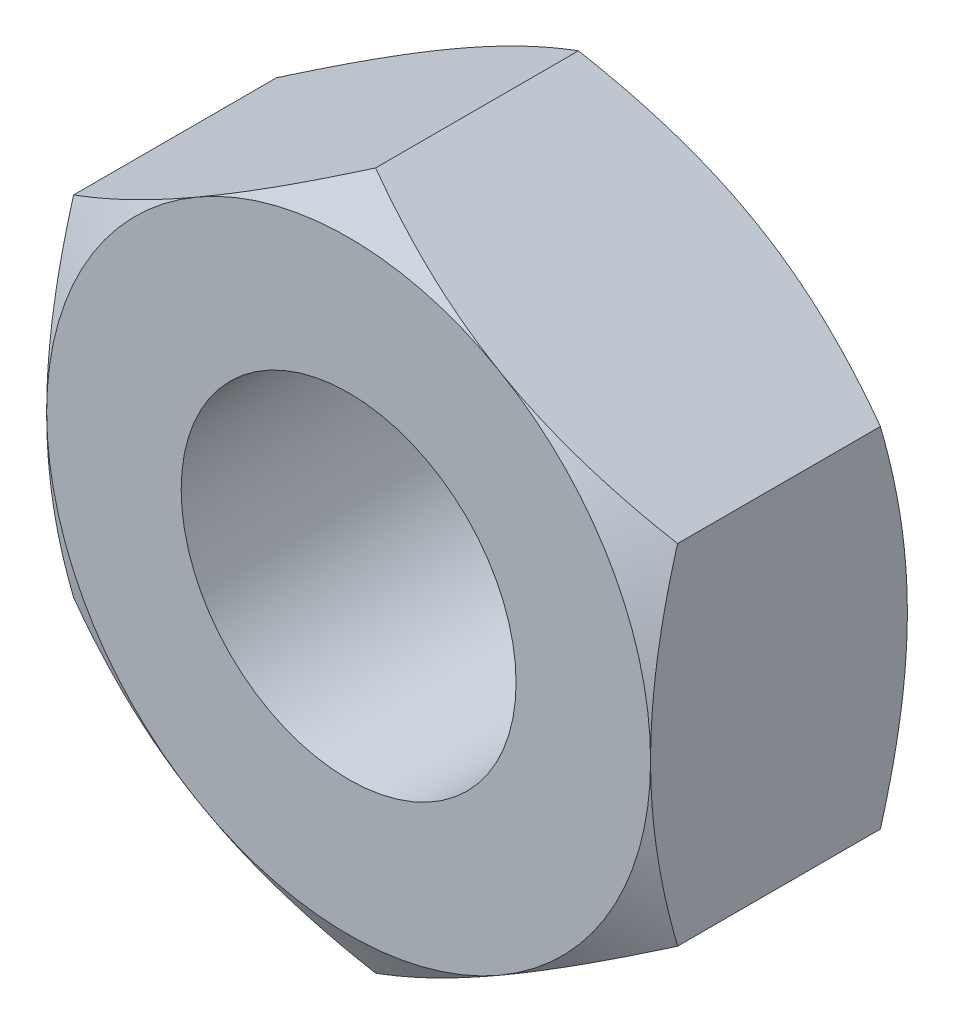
ISO-10303-21;
HEADER;
FILE_DESCRIPTION(('STEP AP214'),'2;1');
FILE_NAME('part.step','',(''),(''),'','','');
FILE_SCHEMA(('AUTOMOTIVE_DESIGN { 1 0 10303 214 1 1 1 1 }'));
ENDSEC;
DATA;
#1=APPLICATION_CONTEXT('core data for automotive mechanical design processes');
#2=APPLICATION_PROTOCOL_DEFINITION('international standard','automotive_design',2000,#1);
#3=PRODUCT_CONTEXT('',#1,'mechanical');
#4=PRODUCT('Part','Part','',(#3));
#5=PRODUCT_RELATED_PRODUCT_CATEGORY('part','',(#4));
#6=PRODUCT_DEFINITION_FORMATION('','',#4);
#7=PRODUCT_DEFINITION_CONTEXT('part definition',#1,'design');
#8=PRODUCT_DEFINITION('design','',#6,#7);
#9=PRODUCT_DEFINITION_SHAPE('','',#8);
#10=(LENGTH_UNIT() NAMED_UNIT(*) SI_UNIT(.MILLI.,.METRE.));
#11=(NAMED_UNIT(*) PLANE_ANGLE_UNIT() SI_UNIT($,.RADIAN.));
#12=(NAMED_UNIT(*) SI_UNIT($,.STERADIAN.) SOLID_ANGLE_UNIT());
#13=UNCERTAINTY_MEASURE_WITH_UNIT(LENGTH_MEASURE(1.E-05),#10,'distance_accuracy_value','');
#14=(GEOMETRIC_REPRESENTATION_CONTEXT(3) GLOBAL_UNCERTAINTY_ASSIGNED_CONTEXT((#13)) GLOBAL_UNIT_ASSIGNED_CONTEXT((#10,
#11,#12)) REPRESENTATION_CONTEXT('',''));
#15=CARTESIAN_POINT('',(0.,0.,0.));
#16=DIRECTION('',(0.,0.,1.));
#17=DIRECTION('',(1.,0.,0.));
#18=AXIS2_PLACEMENT_3D('',#15,#16,#17);
#19=CARTESIAN_POINT('',(-2.705,4.68519743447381,0.));
#20=DIRECTION('',(0.,0.,-1.));
#21=DIRECTION('',(-1.,0.,0.));
#22=AXIS2_PLACEMENT_3D('',#19,#20,#21);
#23=PLANE('',#22);
#24=CARTESIAN_POINT('',(0.,0.,0.));
#25=DIRECTION('',(0.,0.,1.));
#26=DIRECTION('',(1.,0.,0.));
#27=AXIS2_PLACEMENT_3D('',#24,#25,#26);
#28=CIRCLE('',#27,1.5);
#29=CARTESIAN_POINT('',(1.5,0.,0.));
#30=VERTEX_POINT('',#29);
#31=EDGE_CURVE('E316',#30,#30,#28,.T.);
#32=ORIENTED_EDGE('',*,*,#31,.F.);
#33=EDGE_LOOP('',(#32));
#34=FACE_BOUND('',#33,.T.);
#35=CARTESIAN_POINT('',(0.,0.,0.));
#36=DIRECTION('',(0.,0.,-1.));
#37=DIRECTION('',(-1.,0.,0.));
#38=AXIS2_PLACEMENT_3D('',#35,#36,#37);
#39=CIRCLE('',#38,2.705);
#40=CARTESIAN_POINT('',(-2.705,0.,0.));
#41=VERTEX_POINT('',#40);
#42=CARTESIAN_POINT('',(-1.3525,2.34259871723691,0.));
#43=VERTEX_POINT('',#42);
#44=EDGE_CURVE('E324',#41,#43,#39,.T.);
#45=ORIENTED_EDGE('',*,*,#44,.F.);
#46=CARTESIAN_POINT('',(0.,0.,0.));
#47=DIRECTION('',(0.,0.,-1.));
#48=DIRECTION('',(-1.,0.,0.));
#49=AXIS2_PLACEMENT_3D('',#46,#47,#48);
#50=CIRCLE('',#49,2.705);
#51=CARTESIAN_POINT('',(-1.3525,-2.34259871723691,0.));
#52=VERTEX_POINT('',#51);
#53=EDGE_CURVE('E147',#41,#52,#50,.F.);
#54=ORIENTED_EDGE('',*,*,#53,.T.);
#55=CARTESIAN_POINT('',(1.3525,-2.34259871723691,0.));
#56=VERTEX_POINT('',#55);
#57=EDGE_CURVE('E248',#52,#56,#50,.F.);
#58=ORIENTED_EDGE('',*,*,#57,.T.);
#59=CARTESIAN_POINT('',(2.705,0.,0.));
#60=VERTEX_POINT('',#59);
#61=EDGE_CURVE('E150',#56,#60,#50,.F.);
#62=ORIENTED_EDGE('',*,*,#61,.T.);
#63=CARTESIAN_POINT('',(1.3525,2.34259871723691,0.));
#64=VERTEX_POINT('',#63);
#65=EDGE_CURVE('E125',#60,#64,#50,.F.);
#66=ORIENTED_EDGE('',*,*,#65,.T.);
#67=EDGE_CURVE('E138',#64,#43,#50,.F.);
#68=ORIENTED_EDGE('',*,*,#67,.T.);
#69=EDGE_LOOP('',(#45,#54,#58,#62,#66,#68));
#70=FACE_BOUND('',#69,.T.);
#71=ADVANCED_FACE('F30',(#34,#70),#23,.F.);
#72=CARTESIAN_POINT('',(0.,0.,0.));
#73=DIRECTION('',(0.,0.,-1.));
#74=DIRECTION('',(-1.,0.,0.));
#75=AXIS2_PLACEMENT_3D('',#72,#73,#74);
#76=CONICAL_SURFACE('',#75,2.705,1.0471975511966);
#77=CARTESIAN_POINT('',(-2.705,-4.26927198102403,-1.35624103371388));
#78=CARTESIAN_POINT('',(-2.705,-4.15048650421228,-1.29832473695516));
#79=CARTESIAN_POINT('',(-2.705,-4.03143620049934,-1.24094267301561));
#80=CARTESIAN_POINT('',(-2.705,-3.79266538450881,-1.12754604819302));
#81=CARTESIAN_POINT('',(-2.705,-3.6729447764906,-1.07153168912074));
#82=CARTESIAN_POINT('',(-2.705,-3.43211076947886,-0.960903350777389));
#83=CARTESIAN_POINT('',(-2.705,-3.31099337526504,-0.906298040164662));
#84=CARTESIAN_POINT('',(-2.705,-3.06782093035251,-0.799224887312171));
#85=CARTESIAN_POINT('',(-2.705,-2.94576592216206,-0.746756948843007));
#86=CARTESIAN_POINT('',(-2.705,-2.69630359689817,-0.642760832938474));
#87=CARTESIAN_POINT('',(-2.705,-2.5688566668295,-0.591327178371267));
#88=CARTESIAN_POINT('',(-2.705,-2.31249937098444,-0.492175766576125));
#89=CARTESIAN_POINT('',(-2.705,-2.18358884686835,-0.444458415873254));
#90=CARTESIAN_POINT('',(-2.705,-1.92431755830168,-0.353938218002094));
#91=CARTESIAN_POINT('',(-2.705,-1.79396008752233,-0.311126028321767));
#92=CARTESIAN_POINT('',(-2.705,-1.53137640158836,-0.231740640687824));
#93=CARTESIAN_POINT('',(-2.705,-1.39915076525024,-0.195165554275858));
#94=CARTESIAN_POINT('',(-2.705,-1.13350806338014,-0.130159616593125));
#95=CARTESIAN_POINT('',(-2.705,-1.00010270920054,-0.101681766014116));
#96=CARTESIAN_POINT('',(-2.705,-0.73155757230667,-0.054423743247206));
#97=CARTESIAN_POINT('',(-2.705,-0.596417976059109,-0.0356425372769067));
#98=CARTESIAN_POINT('',(-2.705,-0.326873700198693,-0.00951805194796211));
#99=CARTESIAN_POINT('',(-2.705,-0.19248419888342,-0.00202203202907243));
#100=CARTESIAN_POINT('',(-2.705,0.0764530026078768,0.00130372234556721));
#101=CARTESIAN_POINT('',(-2.705,0.211000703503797,-0.00286659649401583));
#102=CARTESIAN_POINT('',(-2.705,0.437276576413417,-0.0193888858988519));
#103=CARTESIAN_POINT('',(-2.705,0.529236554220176,-0.0287742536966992));
#104=CARTESIAN_POINT('',(-2.705,0.712529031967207,-0.0524491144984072));
#105=CARTESIAN_POINT('',(-2.705,0.803861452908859,-0.0667392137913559));
#106=CARTESIAN_POINT('',(-2.705,1.07675813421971,-0.116222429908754));
#107=CARTESIAN_POINT('',(-2.705,1.2571301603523,-0.158020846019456));
#108=CARTESIAN_POINT('',(-2.705,1.61830335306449,-0.255754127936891));
#109=CARTESIAN_POINT('',(-2.705,1.79901948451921,-0.31199122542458));
#110=CARTESIAN_POINT('',(-2.705,2.06757071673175,-0.40352401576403));
#111=CARTESIAN_POINT('',(-2.705,2.1566605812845,-0.435228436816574));
#112=CARTESIAN_POINT('',(-2.705,2.33409482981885,-0.50065730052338));
#113=CARTESIAN_POINT('',(-2.705,2.42243922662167,-0.534381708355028));
#114=CARTESIAN_POINT('',(-2.705,2.64533459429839,-0.621921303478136));
#115=CARTESIAN_POINT('',(-2.705,2.77943863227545,-0.676871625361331));
#116=CARTESIAN_POINT('',(-2.705,3.04636906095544,-0.789802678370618));
#117=CARTESIAN_POINT('',(-2.705,3.17919534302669,-0.847783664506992));
#118=CARTESIAN_POINT('',(-2.705,3.44383155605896,-0.966111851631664));
#119=CARTESIAN_POINT('',(-2.705,3.57564118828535,-1.02645971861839));
#120=CARTESIAN_POINT('',(-2.705,3.83839778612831,-1.14900835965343));
#121=CARTESIAN_POINT('',(-2.705,3.9693447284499,-1.21120918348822));
#122=CARTESIAN_POINT('',(-2.705,4.36148205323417,-1.40017364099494));
#123=CARTESIAN_POINT('',(-2.705,4.62161146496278,-1.52913676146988));
#124=CARTESIAN_POINT('',(-2.705,5.13988064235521,-1.79086598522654));
#125=CARTESIAN_POINT('',(-2.705,5.39802073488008,-1.92363144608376));
#126=CARTESIAN_POINT('',(-2.705,5.88842444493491,-2.17905581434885));
#127=CARTESIAN_POINT('',(-2.705,6.12081339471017,-2.30147453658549));
#128=CARTESIAN_POINT('',(-2.705,6.58475045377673,-2.54791973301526));
#129=CARTESIAN_POINT('',(-2.705,6.81629852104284,-2.67194628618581));
#130=CARTESIAN_POINT('',(-2.705,7.27804038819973,-2.92082818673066));
#131=CARTESIAN_POINT('',(-2.705,7.50823616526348,-3.04567987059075));
#132=CARTESIAN_POINT('',(-2.705,7.96809754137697,-3.29631879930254));
#133=CARTESIAN_POINT('',(-2.705,8.19776317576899,-3.42210597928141));
#134=CARTESIAN_POINT('',(-2.705,8.42723831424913,-3.54823720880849));
#135=B_SPLINE_CURVE_WITH_KNOTS('',3,(#77,#78,#79,#80,#81,#82,#83,#84,#85,#86,#87,#88,#89,#90,
#91,#92,#93,#94,#95,#96,#97,#98,#99,#100,#101,#102,#103,#104,#105,#106,#107,#108,#109,#110,#111,
#112,#113,#114,#115,#116,#117,#118,#119,#120,#121,#122,#123,#124,#125,#126,#127,#128,#129,#130,
#131,#132,#133,#134),.UNSPECIFIED.,.F.,.F.,(4,2,2,2,2,2,2,2,2,2,2,2,2,2,2,2,2,2,2,2,2,2,2,2,2,2,
2,2,4),(0.,0.396462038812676,0.792982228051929,1.19153869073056,1.59007718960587,
2.00233475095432,2.41463734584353,2.82614112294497,3.23752008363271,3.64646009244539,
4.0553564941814,4.45866725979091,4.86197986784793,5.13916088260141,5.41637617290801,
5.97108135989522,6.53850865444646,6.82217890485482,7.10584426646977,7.54056929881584,
7.9753309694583,8.4102158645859,8.84511245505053,9.71608333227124,10.5869079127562,
11.3748833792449,12.1628976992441,12.9485175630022,13.734083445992),.UNSPECIFIED.);
#136=CARTESIAN_POINT('',(-2.705,1.56173247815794,-0.241600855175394));
#137=VERTEX_POINT('',#136);
#138=EDGE_CURVE('E155',#137,#41,#135,.F.);
#139=ORIENTED_EDGE('',*,*,#138,.T.);
#140=ORIENTED_EDGE('',*,*,#44,.T.);
#141=CARTESIAN_POINT('',(0.000200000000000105,3.12358042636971,-0.241667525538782));
#142=CARTESIAN_POINT('',(-0.118671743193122,3.05494979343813,-0.202027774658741));
#143=CARTESIAN_POINT('',(-0.238569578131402,2.98572674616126,-0.165976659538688));
#144=CARTESIAN_POINT('',(-0.480441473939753,2.8460819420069,-0.103048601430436));
#145=CARTESIAN_POINT('',(-0.602419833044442,2.7756577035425,-0.0761939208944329));
#146=CARTESIAN_POINT('',(-0.844864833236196,2.63568201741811,-0.0343900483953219));
#147=CARTESIAN_POINT('',(-0.965294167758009,2.56615210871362,-0.01916264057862));
#148=CARTESIAN_POINT('',(-1.20671959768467,2.42676507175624,-0.000983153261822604));
#149=CARTESIAN_POINT('',(-1.32771481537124,2.35690845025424,0.00198397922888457));
#150=CARTESIAN_POINT('',(-1.55380776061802,2.22637362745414,-0.00418341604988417));
#151=CARTESIAN_POINT('',(-1.65893930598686,2.16567590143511,-0.0118036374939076));
#152=CARTESIAN_POINT('',(-1.86851745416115,2.04467590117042,-0.0359569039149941));
#153=CARTESIAN_POINT('',(-1.97296333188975,1.98437404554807,-0.0524982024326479));
#154=CARTESIAN_POINT('',(-2.18297371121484,1.86312449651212,-0.0938508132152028));
#155=CARTESIAN_POINT('',(-2.28851162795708,1.80219215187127,-0.118837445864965));
#156=CARTESIAN_POINT('',(-2.49801324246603,1.68123633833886,-0.175547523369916));
#157=CARTESIAN_POINT('',(-2.60197962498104,1.62121131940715,-0.207257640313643));
#158=CARTESIAN_POINT('',(-2.7052,1.5616170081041,-0.241667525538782));
#159=B_SPLINE_CURVE_WITH_KNOTS('',3,(#141,#142,#143,#144,#145,#146,#147,#148,#149,#150,#151,
#152,#153,#154,#155,#156,#157,#158),.UNSPECIFIED.,.F.,.F.,(4,2,2,2,2,2,2,2,4),(0.,
0.428779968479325,0.858590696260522,1.27776339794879,1.69642129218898,2.06097746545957,
2.42587149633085,2.79886028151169,3.17111649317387),.UNSPECIFIED.);
#160=EDGE_CURVE('E187',#43,#137,#159,.T.);
#161=ORIENTED_EDGE('',*,*,#160,.T.);
#162=EDGE_LOOP('',(#139,#140,#161));
#163=FACE_BOUND('',#162,.T.);
#164=ADVANCED_FACE('F174',(#163),#76,.T.);
#165=CARTESIAN_POINT('',(2.7052,1.5616170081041,-0.241667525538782));
#166=CARTESIAN_POINT('',(2.58632825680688,1.63024764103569,-0.202027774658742));
#167=CARTESIAN_POINT('',(2.4664304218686,1.69947068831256,-0.165976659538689));
#168=CARTESIAN_POINT('',(2.22455852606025,1.83911549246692,-0.103048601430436));
#169=CARTESIAN_POINT('',(2.10258016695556,1.90953973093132,-0.0761939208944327));
#170=CARTESIAN_POINT('',(1.8601351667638,2.04951541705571,-0.0343900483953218));
#171=CARTESIAN_POINT('',(1.73970583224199,2.1190453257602,-0.0191626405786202));
#172=CARTESIAN_POINT('',(1.49828040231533,2.25843236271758,-0.000983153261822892));
#173=CARTESIAN_POINT('',(1.37728518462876,2.32828898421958,0.00198397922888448));
#174=CARTESIAN_POINT('',(1.15119223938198,2.45882380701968,-0.00418341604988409));
#175=CARTESIAN_POINT('',(1.04606069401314,2.5195215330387,-0.0118036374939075));
#176=CARTESIAN_POINT('',(0.836482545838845,2.6405215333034,-0.0359569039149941));
#177=CARTESIAN_POINT('',(0.732036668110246,2.70082338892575,-0.052498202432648));
#178=CARTESIAN_POINT('',(0.522026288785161,2.8220729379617,-0.0938508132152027));
#179=CARTESIAN_POINT('',(0.416488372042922,2.88300528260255,-0.118837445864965));
#180=CARTESIAN_POINT('',(0.206986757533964,3.00396109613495,-0.175547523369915));
#181=CARTESIAN_POINT('',(0.103020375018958,3.06398611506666,-0.207257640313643));
#182=CARTESIAN_POINT('',(-0.000200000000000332,3.12358042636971,-0.241667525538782));
#183=B_SPLINE_CURVE_WITH_KNOTS('',3,(#165,#166,#167,#168,#169,#170,#171,#172,#173,#174,#175,
#176,#177,#178,#179,#180,#181,#182),.UNSPECIFIED.,.F.,.F.,(4,2,2,2,2,2,2,2,4),(0.,
0.428779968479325,0.858590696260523,1.27776339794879,1.69642129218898,2.06097746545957,
2.42587149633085,2.79886028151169,3.17111649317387),.UNSPECIFIED.);
#184=CARTESIAN_POINT('',(0.,3.12346495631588,-0.241600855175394));
#185=VERTEX_POINT('',#184);
#186=EDGE_CURVE('E134',#64,#185,#183,.T.);
#187=ORIENTED_EDGE('',*,*,#186,.T.);
#188=EDGE_CURVE('E141',#185,#43,#159,.T.);
#189=ORIENTED_EDGE('',*,*,#188,.T.);
#190=ORIENTED_EDGE('',*,*,#67,.F.);
#191=EDGE_LOOP('',(#187,#189,#190));
#192=FACE_BOUND('',#191,.T.);
#193=ADVANCED_FACE('F139',(#192),#76,.T.);
#194=CARTESIAN_POINT('',(2.705,-4.26927198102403,-1.35624103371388));
#195=CARTESIAN_POINT('',(2.705,-4.15048650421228,-1.29832473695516));
#196=CARTESIAN_POINT('',(2.705,-4.03143620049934,-1.24094267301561));
#197=CARTESIAN_POINT('',(2.705,-3.79266538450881,-1.12754604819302));
#198=CARTESIAN_POINT('',(2.705,-3.6729447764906,-1.07153168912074));
#199=CARTESIAN_POINT('',(2.705,-3.43211076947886,-0.960903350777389));
#200=CARTESIAN_POINT('',(2.705,-3.31099337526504,-0.906298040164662));
#201=CARTESIAN_POINT('',(2.705,-3.06782093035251,-0.799224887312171));
#202=CARTESIAN_POINT('',(2.705,-2.94576592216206,-0.746756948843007));
#203=CARTESIAN_POINT('',(2.705,-2.69630359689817,-0.642760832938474));
#204=CARTESIAN_POINT('',(2.705,-2.5688566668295,-0.591327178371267));
#205=CARTESIAN_POINT('',(2.705,-2.31249937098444,-0.492175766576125));
#206=CARTESIAN_POINT('',(2.705,-2.18358884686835,-0.444458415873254));
#207=CARTESIAN_POINT('',(2.705,-1.92431755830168,-0.353938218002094));
#208=CARTESIAN_POINT('',(2.705,-1.79396008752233,-0.311126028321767));
#209=CARTESIAN_POINT('',(2.705,-1.53137640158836,-0.231740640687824));
#210=CARTESIAN_POINT('',(2.705,-1.39915076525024,-0.195165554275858));
#211=CARTESIAN_POINT('',(2.705,-1.13350806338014,-0.130159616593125));
#212=CARTESIAN_POINT('',(2.705,-1.00010270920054,-0.101681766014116));
#213=CARTESIAN_POINT('',(2.705,-0.73155757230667,-0.054423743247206));
#214=CARTESIAN_POINT('',(2.705,-0.596417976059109,-0.0356425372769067));
#215=CARTESIAN_POINT('',(2.705,-0.326873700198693,-0.00951805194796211));
#216=CARTESIAN_POINT('',(2.705,-0.19248419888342,-0.00202203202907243));
#217=CARTESIAN_POINT('',(2.705,0.0764530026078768,0.00130372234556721));
#218=CARTESIAN_POINT('',(2.705,0.211000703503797,-0.00286659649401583));
#219=CARTESIAN_POINT('',(2.705,0.437276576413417,-0.0193888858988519));
#220=CARTESIAN_POINT('',(2.705,0.529236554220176,-0.0287742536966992));
#221=CARTESIAN_POINT('',(2.705,0.712529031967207,-0.0524491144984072));
#222=CARTESIAN_POINT('',(2.705,0.803861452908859,-0.0667392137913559));
#223=CARTESIAN_POINT('',(2.705,1.07675813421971,-0.116222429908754));
#224=CARTESIAN_POINT('',(2.705,1.2571301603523,-0.158020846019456));
#225=CARTESIAN_POINT('',(2.705,1.61830335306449,-0.255754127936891));
#226=CARTESIAN_POINT('',(2.705,1.79901948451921,-0.31199122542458));
#227=CARTESIAN_POINT('',(2.705,2.06757071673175,-0.40352401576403));
#228=CARTESIAN_POINT('',(2.705,2.1566605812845,-0.435228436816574));
#229=CARTESIAN_POINT('',(2.705,2.33409482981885,-0.50065730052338));
#230=CARTESIAN_POINT('',(2.705,2.42243922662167,-0.534381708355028));
#231=CARTESIAN_POINT('',(2.705,2.64533459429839,-0.621921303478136));
#232=CARTESIAN_POINT('',(2.705,2.77943863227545,-0.676871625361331));
#233=CARTESIAN_POINT('',(2.705,3.04636906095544,-0.789802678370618));
#234=CARTESIAN_POINT('',(2.705,3.17919534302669,-0.847783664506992));
#235=CARTESIAN_POINT('',(2.705,3.44383155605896,-0.966111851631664));
#236=CARTESIAN_POINT('',(2.705,3.57564118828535,-1.02645971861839));
#237=CARTESIAN_POINT('',(2.705,3.83839778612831,-1.14900835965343));
#238=CARTESIAN_POINT('',(2.705,3.9693447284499,-1.21120918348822));
#239=CARTESIAN_POINT('',(2.705,4.36148205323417,-1.40017364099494));
#240=CARTESIAN_POINT('',(2.705,4.62161146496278,-1.52913676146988));
#241=CARTESIAN_POINT('',(2.705,5.13988064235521,-1.79086598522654));
#242=CARTESIAN_POINT('',(2.705,5.39802073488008,-1.92363144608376));
#243=CARTESIAN_POINT('',(2.705,5.88842444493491,-2.17905581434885));
#244=CARTESIAN_POINT('',(2.705,6.12081339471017,-2.30147453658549));
#245=CARTESIAN_POINT('',(2.705,6.58475045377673,-2.54791973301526));
#246=CARTESIAN_POINT('',(2.705,6.81629852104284,-2.67194628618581));
#247=CARTESIAN_POINT('',(2.705,7.27804038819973,-2.92082818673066));
#248=CARTESIAN_POINT('',(2.705,7.50823616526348,-3.04567987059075));
#249=CARTESIAN_POINT('',(2.705,7.96809754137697,-3.29631879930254));
#250=CARTESIAN_POINT('',(2.705,8.19776317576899,-3.42210597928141));
#251=CARTESIAN_POINT('',(2.705,8.42723831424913,-3.54823720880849));
#252=B_SPLINE_CURVE_WITH_KNOTS('',3,(#194,#195,#196,#197,#198,#199,#200,#201,#202,#203,#204,
#205,#206,#207,#208,#209,#210,#211,#212,#213,#214,#215,#216,#217,#218,#219,#220,#221,#222,#223,
#224,#225,#226,#227,#228,#229,#230,#231,#232,#233,#234,#235,#236,#237,#238,#239,#240,#241,#242,
#243,#244,#245,#246,#247,#248,#249,#250,#251),.UNSPECIFIED.,.F.,.F.,(4,2,2,2,2,2,2,2,2,2,2,2,2,
2,2,2,2,2,2,2,2,2,2,2,2,2,2,2,4),(0.,0.396462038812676,0.792982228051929,1.19153869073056,
1.59007718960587,2.00233475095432,2.41463734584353,2.82614112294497,3.23752008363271,
3.64646009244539,4.0553564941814,4.45866725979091,4.86197986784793,5.13916088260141,
5.41637617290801,5.97108135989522,6.53850865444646,6.82217890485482,7.10584426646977,
7.54056929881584,7.9753309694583,8.4102158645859,8.84511245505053,9.71608333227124,
10.5869079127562,11.3748833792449,12.1628976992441,12.9485175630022,13.734083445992),.UNSPECIFIED.);
#253=CARTESIAN_POINT('',(2.705,1.56173247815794,-0.241600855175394));
#254=VERTEX_POINT('',#253);
#255=EDGE_CURVE('E128',#60,#254,#252,.T.);
#256=ORIENTED_EDGE('',*,*,#255,.T.);
#257=EDGE_CURVE('E121',#254,#64,#183,.T.);
#258=ORIENTED_EDGE('',*,*,#257,.T.);
#259=ORIENTED_EDGE('',*,*,#65,.F.);
#260=EDGE_LOOP('',(#256,#258,#259));
#261=FACE_BOUND('',#260,.T.);
#262=ADVANCED_FACE('F123',(#261),#76,.T.);
#263=CARTESIAN_POINT('',(-0.000200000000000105,-3.12358042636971,-0.241667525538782));
#264=CARTESIAN_POINT('',(0.118671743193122,-3.05494979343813,-0.202027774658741));
#265=CARTESIAN_POINT('',(0.238569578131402,-2.98572674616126,-0.165976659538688));
#266=CARTESIAN_POINT('',(0.480441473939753,-2.8460819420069,-0.103048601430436));
#267=CARTESIAN_POINT('',(0.602419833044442,-2.7756577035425,-0.0761939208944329));
#268=CARTESIAN_POINT('',(0.844864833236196,-2.63568201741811,-0.0343900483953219));
#269=CARTESIAN_POINT('',(0.965294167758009,-2.56615210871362,-0.01916264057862));
#270=CARTESIAN_POINT('',(1.20671959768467,-2.42676507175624,-0.000983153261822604));
#271=CARTESIAN_POINT('',(1.32771481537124,-2.35690845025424,0.00198397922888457));
#272=CARTESIAN_POINT('',(1.55380776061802,-2.22637362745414,-0.00418341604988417));
#273=CARTESIAN_POINT('',(1.65893930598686,-2.16567590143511,-0.0118036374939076));
#274=CARTESIAN_POINT('',(1.86851745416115,-2.04467590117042,-0.0359569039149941));
#275=CARTESIAN_POINT('',(1.97296333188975,-1.98437404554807,-0.0524982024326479));
#276=CARTESIAN_POINT('',(2.18297371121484,-1.86312449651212,-0.0938508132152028));
#277=CARTESIAN_POINT('',(2.28851162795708,-1.80219215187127,-0.118837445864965));
#278=CARTESIAN_POINT('',(2.49801324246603,-1.68123633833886,-0.175547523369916));
#279=CARTESIAN_POINT('',(2.60197962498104,-1.62121131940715,-0.207257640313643));
#280=CARTESIAN_POINT('',(2.7052,-1.5616170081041,-0.241667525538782));
#281=B_SPLINE_CURVE_WITH_KNOTS('',3,(#263,#264,#265,#266,#267,#268,#269,#270,#271,#272,#273,
#274,#275,#276,#277,#278,#279,#280),.UNSPECIFIED.,.F.,.F.,(4,2,2,2,2,2,2,2,4),(0.,
0.428779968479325,0.858590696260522,1.27776339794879,1.69642129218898,2.06097746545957,
2.42587149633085,2.79886028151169,3.17111649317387),.UNSPECIFIED.);
#282=CARTESIAN_POINT('',(2.705,-1.56173247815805,-0.241600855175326));
#283=VERTEX_POINT('',#282);
#284=EDGE_CURVE('E201',#56,#283,#281,.T.);
#285=ORIENTED_EDGE('',*,*,#284,.T.);
#286=EDGE_CURVE('E200',#283,#60,#252,.T.);
#287=ORIENTED_EDGE('',*,*,#286,.T.);
#288=ORIENTED_EDGE('',*,*,#61,.F.);
#289=EDGE_LOOP('',(#285,#287,#288));
#290=FACE_BOUND('',#289,.T.);
#291=ADVANCED_FACE('F425',(#290),#76,.T.);
#292=CARTESIAN_POINT('',(0.,-3.12346495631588,-0.241600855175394));
#293=VERTEX_POINT('',#292);
#294=EDGE_CURVE('E258',#293,#56,#281,.T.);
#295=ORIENTED_EDGE('',*,*,#294,.T.);
#296=ORIENTED_EDGE('',*,*,#57,.F.);
#297=CARTESIAN_POINT('',(-2.7052,-1.5616170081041,-0.241667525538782));
#298=CARTESIAN_POINT('',(-2.58632825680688,-1.63024764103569,-0.202027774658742));
#299=CARTESIAN_POINT('',(-2.4664304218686,-1.69947068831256,-0.165976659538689));
#300=CARTESIAN_POINT('',(-2.22455852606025,-1.83911549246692,-0.103048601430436));
#301=CARTESIAN_POINT('',(-2.10258016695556,-1.90953973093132,-0.0761939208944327));
#302=CARTESIAN_POINT('',(-1.8601351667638,-2.04951541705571,-0.0343900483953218));
#303=CARTESIAN_POINT('',(-1.73970583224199,-2.1190453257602,-0.0191626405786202));
#304=CARTESIAN_POINT('',(-1.49828040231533,-2.25843236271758,-0.000983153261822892));
#305=CARTESIAN_POINT('',(-1.37728518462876,-2.32828898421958,0.00198397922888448));
#306=CARTESIAN_POINT('',(-1.15119223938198,-2.45882380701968,-0.00418341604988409));
#307=CARTESIAN_POINT('',(-1.04606069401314,-2.5195215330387,-0.0118036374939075));
#308=CARTESIAN_POINT('',(-0.836482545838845,-2.6405215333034,-0.0359569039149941));
#309=CARTESIAN_POINT('',(-0.732036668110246,-2.70082338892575,-0.052498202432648));
#310=CARTESIAN_POINT('',(-0.522026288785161,-2.8220729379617,-0.0938508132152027));
#311=CARTESIAN_POINT('',(-0.416488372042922,-2.88300528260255,-0.118837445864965));
#312=CARTESIAN_POINT('',(-0.206986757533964,-3.00396109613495,-0.175547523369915));
#313=CARTESIAN_POINT('',(-0.103020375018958,-3.06398611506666,-0.207257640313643));
#314=CARTESIAN_POINT('',(0.000200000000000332,-3.12358042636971,-0.241667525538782));
#315=B_SPLINE_CURVE_WITH_KNOTS('',3,(#297,#298,#299,#300,#301,#302,#303,#304,#305,#306,#307,
#308,#309,#310,#311,#312,#313,#314),.UNSPECIFIED.,.F.,.F.,(4,2,2,2,2,2,2,2,4),(0.,
0.428779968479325,0.858590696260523,1.27776339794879,1.69642129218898,2.06097746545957,
2.42587149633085,2.79886028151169,3.17111649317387),.UNSPECIFIED.);
#316=EDGE_CURVE('E262',#52,#293,#315,.T.);
#317=ORIENTED_EDGE('',*,*,#316,.T.);
#318=EDGE_LOOP('',(#295,#296,#317));
#319=FACE_BOUND('',#318,.T.);
#320=ADVANCED_FACE('F180',(#319),#76,.T.);
#321=CARTESIAN_POINT('',(-2.705,-1.56173247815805,-0.241600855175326));
#322=VERTEX_POINT('',#321);
#323=EDGE_CURVE('E168',#322,#52,#315,.T.);
#324=ORIENTED_EDGE('',*,*,#323,.T.);
#325=ORIENTED_EDGE('',*,*,#53,.F.);
#326=EDGE_CURVE('E133',#41,#322,#135,.F.);
#327=ORIENTED_EDGE('',*,*,#326,.T.);
#328=EDGE_LOOP('',(#324,#325,#327));
#329=FACE_BOUND('',#328,.T.);
#330=ADVANCED_FACE('F267',(#329),#76,.T.);
#331=CARTESIAN_POINT('',(2.705,1.56173247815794,-2.3));
#332=DIRECTION('',(0.499999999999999,0.866025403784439,0.));
#333=DIRECTION('',(-0.866025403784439,0.499999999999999,0.));
#334=AXIS2_PLACEMENT_3D('',#331,#332,#333);
#335=PLANE('',#334);
#336=CARTESIAN_POINT('',(-0.0002,3.12358042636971,-2.05833247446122));
#337=CARTESIAN_POINT('',(0.118671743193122,3.05494979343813,-2.09797222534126));
#338=CARTESIAN_POINT('',(0.238569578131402,2.98572674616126,-2.13402334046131));
#339=CARTESIAN_POINT('',(0.480441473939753,2.8460819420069,-2.19695139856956));
#340=CARTESIAN_POINT('',(0.602419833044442,2.7756577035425,-2.22380607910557));
#341=CARTESIAN_POINT('',(0.844864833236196,2.63568201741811,-2.26560995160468));
#342=CARTESIAN_POINT('',(0.965294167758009,2.56615210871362,-2.28083735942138));
#343=CARTESIAN_POINT('',(1.20671959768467,2.42676507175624,-2.29901684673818));
#344=CARTESIAN_POINT('',(1.32771481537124,2.35690845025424,-2.30198397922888));
#345=CARTESIAN_POINT('',(1.55380776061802,2.22637362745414,-2.29581658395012));
#346=CARTESIAN_POINT('',(1.65893930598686,2.16567590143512,-2.28819636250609));
#347=CARTESIAN_POINT('',(1.86851745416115,2.04467590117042,-2.26404309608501));
#348=CARTESIAN_POINT('',(1.97296333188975,1.98437404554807,-2.24750179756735));
#349=CARTESIAN_POINT('',(2.18297371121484,1.86312449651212,-2.2061491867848));
#350=CARTESIAN_POINT('',(2.28851162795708,1.80219215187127,-2.18116255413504));
#351=CARTESIAN_POINT('',(2.49801324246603,1.68123633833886,-2.12445247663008));
#352=CARTESIAN_POINT('',(2.60197962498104,1.62121131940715,-2.09274235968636));
#353=CARTESIAN_POINT('',(2.7052,1.5616170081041,-2.05833247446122));
#354=B_SPLINE_CURVE_WITH_KNOTS('',3,(#336,#337,#338,#339,#340,#341,#342,#343,#344,#345,#346,
#347,#348,#349,#350,#351,#352,#353),.UNSPECIFIED.,.F.,.F.,(4,2,2,2,2,2,2,2,4),(0.,
0.428779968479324,0.858590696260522,1.27776339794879,1.69642129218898,2.06097746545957,
2.42587149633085,2.79886028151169,3.17111649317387),.UNSPECIFIED.);
#355=CARTESIAN_POINT('',(0.,3.12346495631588,-2.05839914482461));
#356=VERTEX_POINT('',#355);
#357=CARTESIAN_POINT('',(1.3525,2.34259871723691,-2.3));
#358=VERTEX_POINT('',#357);
#359=EDGE_CURVE('E233',#356,#358,#354,.T.);
#360=ORIENTED_EDGE('',*,*,#359,.F.);
#361=DIRECTION('',(0.,0.,1.));
#362=VECTOR('',#361,1.);
#363=CARTESIAN_POINT('',(0.,3.12346495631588,-2.3));
#364=LINE('',#363,#362);
#365=EDGE_CURVE('E154',#356,#185,#364,.T.);
#366=ORIENTED_EDGE('',*,*,#365,.T.);
#367=ORIENTED_EDGE('',*,*,#186,.F.);
#368=ORIENTED_EDGE('',*,*,#257,.F.);
#369=DIRECTION('',(0.,0.,1.));
#370=VECTOR('',#369,1.);
#371=CARTESIAN_POINT('',(2.705,1.56173247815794,-2.3));
#372=LINE('',#371,#370);
#373=CARTESIAN_POINT('',(2.705,1.56173247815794,-2.05839914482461));
#374=VERTEX_POINT('',#373);
#375=EDGE_CURVE('E146',#374,#254,#372,.T.);
#376=ORIENTED_EDGE('',*,*,#375,.F.);
#377=EDGE_CURVE('E228',#358,#374,#354,.T.);
#378=ORIENTED_EDGE('',*,*,#377,.F.);
#379=EDGE_LOOP('',(#360,#366,#367,#368,#376,#378));
#380=FACE_BOUND('',#379,.T.);
#381=ADVANCED_FACE('F32',(#380),#335,.T.);
#382=CARTESIAN_POINT('',(2.705,-1.56173247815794,-2.3));
#383=DIRECTION('',(1.,0.,0.));
#384=DIRECTION('',(0.,0.,-1.));
#385=AXIS2_PLACEMENT_3D('',#382,#383,#384);
#386=PLANE('',#385);
#387=CARTESIAN_POINT('',(2.705,-4.26927198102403,-0.943758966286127));
#388=CARTESIAN_POINT('',(2.705,-4.15048650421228,-1.00167526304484));
#389=CARTESIAN_POINT('',(2.705,-4.03143620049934,-1.05905732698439));
#390=CARTESIAN_POINT('',(2.705,-3.79266538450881,-1.17245395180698));
#391=CARTESIAN_POINT('',(2.705,-3.6729447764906,-1.22846831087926));
#392=CARTESIAN_POINT('',(2.705,-3.43211076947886,-1.33909664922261));
#393=CARTESIAN_POINT('',(2.705,-3.31099337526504,-1.39370195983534));
#394=CARTESIAN_POINT('',(2.705,-3.06782093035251,-1.50077511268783));
#395=CARTESIAN_POINT('',(2.705,-2.94576592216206,-1.55324305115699));
#396=CARTESIAN_POINT('',(2.705,-2.69630359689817,-1.65723916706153));
#397=CARTESIAN_POINT('',(2.705,-2.5688566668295,-1.70867282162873));
#398=CARTESIAN_POINT('',(2.705,-2.31249937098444,-1.80782423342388));
#399=CARTESIAN_POINT('',(2.705,-2.18358884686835,-1.85554158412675));
#400=CARTESIAN_POINT('',(2.705,-1.92431755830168,-1.94606178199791));
#401=CARTESIAN_POINT('',(2.705,-1.79396008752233,-1.98887397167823));
#402=CARTESIAN_POINT('',(2.705,-1.53137640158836,-2.06825935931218));
#403=CARTESIAN_POINT('',(2.705,-1.39915076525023,-2.10483444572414));
#404=CARTESIAN_POINT('',(2.705,-1.13350806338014,-2.16984038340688));
#405=CARTESIAN_POINT('',(2.705,-1.00010270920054,-2.19831823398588));
#406=CARTESIAN_POINT('',(2.705,-0.73155757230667,-2.24557625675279));
#407=CARTESIAN_POINT('',(2.705,-0.596417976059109,-2.26435746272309));
#408=CARTESIAN_POINT('',(2.705,-0.326873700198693,-2.29048194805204));
#409=CARTESIAN_POINT('',(2.705,-0.19248419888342,-2.29797796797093));
#410=CARTESIAN_POINT('',(2.705,0.076453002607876,-2.30130372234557));
#411=CARTESIAN_POINT('',(2.705,0.211000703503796,-2.29713340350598));
#412=CARTESIAN_POINT('',(2.705,0.437276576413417,-2.28061111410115));
#413=CARTESIAN_POINT('',(2.705,0.529236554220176,-2.2712257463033));
#414=CARTESIAN_POINT('',(2.705,0.712529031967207,-2.24755088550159));
#415=CARTESIAN_POINT('',(2.705,0.80386145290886,-2.23326078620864));
#416=CARTESIAN_POINT('',(2.705,1.07675813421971,-2.18377757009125));
#417=CARTESIAN_POINT('',(2.705,1.25713016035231,-2.14197915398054));
#418=CARTESIAN_POINT('',(2.705,1.61830335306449,-2.04424587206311));
#419=CARTESIAN_POINT('',(2.705,1.79901948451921,-1.98800877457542));
#420=CARTESIAN_POINT('',(2.705,2.06757071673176,-1.89647598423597));
#421=CARTESIAN_POINT('',(2.705,2.1566605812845,-1.86477156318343));
#422=CARTESIAN_POINT('',(2.705,2.33409482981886,-1.79934269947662));
#423=CARTESIAN_POINT('',(2.705,2.42243922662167,-1.76561829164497));
#424=CARTESIAN_POINT('',(2.705,2.64533459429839,-1.67807869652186));
#425=CARTESIAN_POINT('',(2.705,2.77943863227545,-1.62312837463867));
#426=CARTESIAN_POINT('',(2.705,3.04636906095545,-1.51019732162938));
#427=CARTESIAN_POINT('',(2.705,3.17919534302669,-1.45221633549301));
#428=CARTESIAN_POINT('',(2.705,3.44383155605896,-1.33388814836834));
#429=CARTESIAN_POINT('',(2.705,3.57564118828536,-1.27354028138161));
#430=CARTESIAN_POINT('',(2.705,3.83839778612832,-1.15099164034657));
#431=CARTESIAN_POINT('',(2.705,3.96934472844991,-1.08879081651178));
#432=CARTESIAN_POINT('',(2.705,4.36148205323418,-0.899826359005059));
#433=CARTESIAN_POINT('',(2.705,4.62161146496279,-0.770863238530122));
#434=CARTESIAN_POINT('',(2.705,5.13988064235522,-0.509134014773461));
#435=CARTESIAN_POINT('',(2.705,5.39802073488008,-0.376368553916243));
#436=CARTESIAN_POINT('',(2.705,5.88842444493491,-0.120944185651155));
#437=CARTESIAN_POINT('',(2.705,6.12081339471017,0.0014745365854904));
#438=CARTESIAN_POINT('',(2.705,6.58475045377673,0.247919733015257));
#439=CARTESIAN_POINT('',(2.705,6.81629852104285,0.37194628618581));
#440=CARTESIAN_POINT('',(2.705,7.27804038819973,0.620828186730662));
#441=CARTESIAN_POINT('',(2.705,7.50823616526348,0.745679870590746));
#442=CARTESIAN_POINT('',(2.705,7.96809754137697,0.996318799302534));
#443=CARTESIAN_POINT('',(2.705,8.19776317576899,1.12210597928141));
#444=CARTESIAN_POINT('',(2.705,8.42723831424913,1.24823720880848));
#445=B_SPLINE_CURVE_WITH_KNOTS('',3,(#387,#388,#389,#390,#391,#392,#393,#394,#395,#396,#397,
#398,#399,#400,#401,#402,#403,#404,#405,#406,#407,#408,#409,#410,#411,#412,#413,#414,#415,#416,
#417,#418,#419,#420,#421,#422,#423,#424,#425,#426,#427,#428,#429,#430,#431,#432,#433,#434,#435,
#436,#437,#438,#439,#440,#441,#442,#443,#444),.UNSPECIFIED.,.F.,.F.,(4,2,2,2,2,2,2,2,2,2,2,2,2,
2,2,2,2,2,2,2,2,2,2,2,2,2,2,2,4),(0.,0.396462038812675,0.792982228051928,1.19153869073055,
1.59007718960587,2.00233475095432,2.41463734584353,2.82614112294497,3.23752008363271,
3.64646009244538,4.05535649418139,4.45866725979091,4.86197986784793,5.13916088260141,
5.416376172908,5.97108135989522,6.53850865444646,6.82217890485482,7.10584426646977,
7.54056929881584,7.9753309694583,8.4102158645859,8.84511245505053,9.71608333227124,
10.5869079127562,11.3748833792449,12.1628976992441,12.9485175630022,13.734083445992),.UNSPECIFIED.);
#446=CARTESIAN_POINT('',(2.705,0.,-2.3));
#447=VERTEX_POINT('',#446);
#448=EDGE_CURVE('E222',#374,#447,#445,.F.);
#449=ORIENTED_EDGE('',*,*,#448,.F.);
#450=ORIENTED_EDGE('',*,*,#375,.T.);
#451=ORIENTED_EDGE('',*,*,#255,.F.);
#452=ORIENTED_EDGE('',*,*,#286,.F.);
#453=DIRECTION('',(0.,0.,1.));
#454=VECTOR('',#453,1.);
#455=CARTESIAN_POINT('',(2.705,-1.56173247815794,-2.3));
#456=LINE('',#455,#454);
#457=CARTESIAN_POINT('',(2.705,-1.56173247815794,-2.05839914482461));
#458=VERTEX_POINT('',#457);
#459=EDGE_CURVE('E235',#458,#283,#456,.T.);
#460=ORIENTED_EDGE('',*,*,#459,.F.);
#461=EDGE_CURVE('E216',#447,#458,#445,.F.);
#462=ORIENTED_EDGE('',*,*,#461,.F.);
#463=EDGE_LOOP('',(#449,#450,#451,#452,#460,#462));
#464=FACE_BOUND('',#463,.T.);
#465=ADVANCED_FACE('F207',(#464),#386,.T.);
#466=CARTESIAN_POINT('',(2.705,-1.56173247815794,-2.3));
#467=DIRECTION('',(0.499999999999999,-0.866025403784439,0.));
#468=DIRECTION('',(0.866025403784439,0.499999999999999,0.));
#469=AXIS2_PLACEMENT_3D('',#466,#467,#468);
#470=PLANE('',#469);
#471=CARTESIAN_POINT('',(2.7052,-1.5616170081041,-2.05833247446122));
#472=CARTESIAN_POINT('',(2.58632825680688,-1.63024764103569,-2.09797222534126));
#473=CARTESIAN_POINT('',(2.4664304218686,-1.69947068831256,-2.13402334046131));
#474=CARTESIAN_POINT('',(2.22455852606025,-1.83911549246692,-2.19695139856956));
#475=CARTESIAN_POINT('',(2.10258016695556,-1.90953973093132,-2.22380607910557));
#476=CARTESIAN_POINT('',(1.8601351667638,-2.04951541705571,-2.26560995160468));
#477=CARTESIAN_POINT('',(1.73970583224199,-2.1190453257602,-2.28083735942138));
#478=CARTESIAN_POINT('',(1.49828040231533,-2.25843236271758,-2.29901684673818));
#479=CARTESIAN_POINT('',(1.37728518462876,-2.32828898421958,-2.30198397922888));
#480=CARTESIAN_POINT('',(1.15119223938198,-2.45882380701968,-2.29581658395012));
#481=CARTESIAN_POINT('',(1.04606069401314,-2.5195215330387,-2.28819636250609));
#482=CARTESIAN_POINT('',(0.836482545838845,-2.6405215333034,-2.26404309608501));
#483=CARTESIAN_POINT('',(0.732036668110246,-2.70082338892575,-2.24750179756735));
#484=CARTESIAN_POINT('',(0.522026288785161,-2.8220729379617,-2.2061491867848));
#485=CARTESIAN_POINT('',(0.416488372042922,-2.88300528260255,-2.18116255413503));
#486=CARTESIAN_POINT('',(0.206986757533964,-3.00396109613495,-2.12445247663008));
#487=CARTESIAN_POINT('',(0.103020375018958,-3.06398611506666,-2.09274235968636));
#488=CARTESIAN_POINT('',(-0.000199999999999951,-3.12358042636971,-2.05833247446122));
#489=B_SPLINE_CURVE_WITH_KNOTS('',3,(#471,#472,#473,#474,#475,#476,#477,#478,#479,#480,#481,
#482,#483,#484,#485,#486,#487,#488),.UNSPECIFIED.,.F.,.F.,(4,2,2,2,2,2,2,2,4),(0.,
0.428779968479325,0.858590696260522,1.27776339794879,1.69642129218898,2.06097746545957,
2.42587149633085,2.79886028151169,3.17111649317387),.UNSPECIFIED.);
#490=CARTESIAN_POINT('',(1.3525,-2.34259871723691,-2.3));
#491=VERTEX_POINT('',#490);
#492=EDGE_CURVE('E54',#458,#491,#489,.T.);
#493=ORIENTED_EDGE('',*,*,#492,.F.);
#494=ORIENTED_EDGE('',*,*,#459,.T.);
#495=ORIENTED_EDGE('',*,*,#284,.F.);
#496=ORIENTED_EDGE('',*,*,#294,.F.);
#497=DIRECTION('',(0.,0.,1.));
#498=VECTOR('',#497,1.);
#499=CARTESIAN_POINT('',(0.,-3.12346495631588,-2.3));
#500=LINE('',#499,#498);
#501=CARTESIAN_POINT('',(0.,-3.12346495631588,-2.05839914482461));
#502=VERTEX_POINT('',#501);
#503=EDGE_CURVE('E238',#502,#293,#500,.T.);
#504=ORIENTED_EDGE('',*,*,#503,.F.);
#505=EDGE_CURVE('E223',#491,#502,#489,.T.);
#506=ORIENTED_EDGE('',*,*,#505,.F.);
#507=EDGE_LOOP('',(#493,#494,#495,#496,#504,#506));
#508=FACE_BOUND('',#507,.T.);
#509=ADVANCED_FACE('F211',(#508),#470,.T.);
#510=CARTESIAN_POINT('',(-2.705,-1.56173247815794,-2.3));
#511=DIRECTION('',(-0.499999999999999,-0.866025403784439,0.));
#512=DIRECTION('',(0.866025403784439,-0.499999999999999,0.));
#513=AXIS2_PLACEMENT_3D('',#510,#511,#512);
#514=PLANE('',#513);
#515=CARTESIAN_POINT('',(0.0002,-3.12358042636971,-2.05833247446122));
#516=CARTESIAN_POINT('',(-0.118671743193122,-3.05494979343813,-2.09797222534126));
#517=CARTESIAN_POINT('',(-0.238569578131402,-2.98572674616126,-2.13402334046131));
#518=CARTESIAN_POINT('',(-0.480441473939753,-2.8460819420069,-2.19695139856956));
#519=CARTESIAN_POINT('',(-0.602419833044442,-2.7756577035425,-2.22380607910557));
#520=CARTESIAN_POINT('',(-0.844864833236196,-2.63568201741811,-2.26560995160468));
#521=CARTESIAN_POINT('',(-0.965294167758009,-2.56615210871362,-2.28083735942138));
#522=CARTESIAN_POINT('',(-1.20671959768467,-2.42676507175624,-2.29901684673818));
#523=CARTESIAN_POINT('',(-1.32771481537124,-2.35690845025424,-2.30198397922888));
#524=CARTESIAN_POINT('',(-1.55380776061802,-2.22637362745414,-2.29581658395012));
#525=CARTESIAN_POINT('',(-1.65893930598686,-2.16567590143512,-2.28819636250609));
#526=CARTESIAN_POINT('',(-1.86851745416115,-2.04467590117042,-2.26404309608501));
#527=CARTESIAN_POINT('',(-1.97296333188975,-1.98437404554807,-2.24750179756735));
#528=CARTESIAN_POINT('',(-2.18297371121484,-1.86312449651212,-2.2061491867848));
#529=CARTESIAN_POINT('',(-2.28851162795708,-1.80219215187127,-2.18116255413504));
#530=CARTESIAN_POINT('',(-2.49801324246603,-1.68123633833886,-2.12445247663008));
#531=CARTESIAN_POINT('',(-2.60197962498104,-1.62121131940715,-2.09274235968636));
#532=CARTESIAN_POINT('',(-2.7052,-1.5616170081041,-2.05833247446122));
#533=B_SPLINE_CURVE_WITH_KNOTS('',3,(#515,#516,#517,#518,#519,#520,#521,#522,#523,#524,#525,
#526,#527,#528,#529,#530,#531,#532),.UNSPECIFIED.,.F.,.F.,(4,2,2,2,2,2,2,2,4),(0.,
0.428779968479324,0.858590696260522,1.27776339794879,1.69642129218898,2.06097746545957,
2.42587149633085,2.79886028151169,3.17111649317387),.UNSPECIFIED.);
#534=CARTESIAN_POINT('',(-1.3525,-2.34259871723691,-2.3));
#535=VERTEX_POINT('',#534);
#536=EDGE_CURVE('E47',#502,#535,#533,.T.);
#537=ORIENTED_EDGE('',*,*,#536,.F.);
#538=ORIENTED_EDGE('',*,*,#503,.T.);
#539=ORIENTED_EDGE('',*,*,#316,.F.);
#540=ORIENTED_EDGE('',*,*,#323,.F.);
#541=DIRECTION('',(0.,0.,1.));
#542=VECTOR('',#541,1.);
#543=CARTESIAN_POINT('',(-2.705,-1.56173247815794,-2.3));
#544=LINE('',#543,#542);
#545=CARTESIAN_POINT('',(-2.705,-1.56173247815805,-2.05839914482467));
#546=VERTEX_POINT('',#545);
#547=EDGE_CURVE('E241',#546,#322,#544,.T.);
#548=ORIENTED_EDGE('',*,*,#547,.F.);
#549=EDGE_CURVE('E282',#535,#546,#533,.T.);
#550=ORIENTED_EDGE('',*,*,#549,.F.);
#551=EDGE_LOOP('',(#537,#538,#539,#540,#548,#550));
#552=FACE_BOUND('',#551,.T.);
#553=ADVANCED_FACE('F272',(#552),#514,.T.);
#554=CARTESIAN_POINT('',(-2.705,-1.56173247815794,-2.3));
#555=DIRECTION('',(-1.,0.,0.));
#556=DIRECTION('',(0.,0.,1.));
#557=AXIS2_PLACEMENT_3D('',#554,#555,#556);
#558=PLANE('',#557);
#559=CARTESIAN_POINT('',(-2.705,-4.26927198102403,-0.943758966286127));
#560=CARTESIAN_POINT('',(-2.705,-4.15048650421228,-1.00167526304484));
#561=CARTESIAN_POINT('',(-2.705,-4.03143620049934,-1.05905732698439));
#562=CARTESIAN_POINT('',(-2.705,-3.79266538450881,-1.17245395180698));
#563=CARTESIAN_POINT('',(-2.705,-3.6729447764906,-1.22846831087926));
#564=CARTESIAN_POINT('',(-2.705,-3.43211076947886,-1.33909664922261));
#565=CARTESIAN_POINT('',(-2.705,-3.31099337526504,-1.39370195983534));
#566=CARTESIAN_POINT('',(-2.705,-3.06782093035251,-1.50077511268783));
#567=CARTESIAN_POINT('',(-2.705,-2.94576592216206,-1.55324305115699));
#568=CARTESIAN_POINT('',(-2.705,-2.69630359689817,-1.65723916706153));
#569=CARTESIAN_POINT('',(-2.705,-2.5688566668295,-1.70867282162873));
#570=CARTESIAN_POINT('',(-2.705,-2.31249937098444,-1.80782423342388));
#571=CARTESIAN_POINT('',(-2.705,-2.18358884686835,-1.85554158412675));
#572=CARTESIAN_POINT('',(-2.705,-1.92431755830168,-1.94606178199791));
#573=CARTESIAN_POINT('',(-2.705,-1.79396008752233,-1.98887397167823));
#574=CARTESIAN_POINT('',(-2.705,-1.53137640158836,-2.06825935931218));
#575=CARTESIAN_POINT('',(-2.705,-1.39915076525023,-2.10483444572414));
#576=CARTESIAN_POINT('',(-2.705,-1.13350806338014,-2.16984038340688));
#577=CARTESIAN_POINT('',(-2.705,-1.00010270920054,-2.19831823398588));
#578=CARTESIAN_POINT('',(-2.705,-0.73155757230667,-2.24557625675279));
#579=CARTESIAN_POINT('',(-2.705,-0.596417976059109,-2.26435746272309));
#580=CARTESIAN_POINT('',(-2.705,-0.326873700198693,-2.29048194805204));
#581=CARTESIAN_POINT('',(-2.705,-0.19248419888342,-2.29797796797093));
#582=CARTESIAN_POINT('',(-2.705,0.076453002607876,-2.30130372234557));
#583=CARTESIAN_POINT('',(-2.705,0.211000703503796,-2.29713340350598));
#584=CARTESIAN_POINT('',(-2.705,0.437276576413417,-2.28061111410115));
#585=CARTESIAN_POINT('',(-2.705,0.529236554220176,-2.2712257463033));
#586=CARTESIAN_POINT('',(-2.705,0.712529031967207,-2.24755088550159));
#587=CARTESIAN_POINT('',(-2.705,0.80386145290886,-2.23326078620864));
#588=CARTESIAN_POINT('',(-2.705,1.07675813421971,-2.18377757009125));
#589=CARTESIAN_POINT('',(-2.705,1.25713016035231,-2.14197915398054));
#590=CARTESIAN_POINT('',(-2.705,1.61830335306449,-2.04424587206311));
#591=CARTESIAN_POINT('',(-2.705,1.79901948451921,-1.98800877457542));
#592=CARTESIAN_POINT('',(-2.705,2.06757071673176,-1.89647598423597));
#593=CARTESIAN_POINT('',(-2.705,2.1566605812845,-1.86477156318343));
#594=CARTESIAN_POINT('',(-2.705,2.33409482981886,-1.79934269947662));
#595=CARTESIAN_POINT('',(-2.705,2.42243922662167,-1.76561829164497));
#596=CARTESIAN_POINT('',(-2.705,2.64533459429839,-1.67807869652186));
#597=CARTESIAN_POINT('',(-2.705,2.77943863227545,-1.62312837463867));
#598=CARTESIAN_POINT('',(-2.705,3.04636906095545,-1.51019732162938));
#599=CARTESIAN_POINT('',(-2.705,3.17919534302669,-1.45221633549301));
#600=CARTESIAN_POINT('',(-2.705,3.44383155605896,-1.33388814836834));
#601=CARTESIAN_POINT('',(-2.705,3.57564118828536,-1.27354028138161));
#602=CARTESIAN_POINT('',(-2.705,3.83839778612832,-1.15099164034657));
#603=CARTESIAN_POINT('',(-2.705,3.96934472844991,-1.08879081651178));
#604=CARTESIAN_POINT('',(-2.705,4.36148205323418,-0.899826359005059));
#605=CARTESIAN_POINT('',(-2.705,4.62161146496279,-0.770863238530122));
#606=CARTESIAN_POINT('',(-2.705,5.13988064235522,-0.509134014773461));
#607=CARTESIAN_POINT('',(-2.705,5.39802073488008,-0.376368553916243));
#608=CARTESIAN_POINT('',(-2.705,5.88842444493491,-0.120944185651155));
#609=CARTESIAN_POINT('',(-2.705,6.12081339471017,0.0014745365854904));
#610=CARTESIAN_POINT('',(-2.705,6.58475045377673,0.247919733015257));
#611=CARTESIAN_POINT('',(-2.705,6.81629852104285,0.37194628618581));
#612=CARTESIAN_POINT('',(-2.705,7.27804038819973,0.620828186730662));
#613=CARTESIAN_POINT('',(-2.705,7.50823616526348,0.745679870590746));
#614=CARTESIAN_POINT('',(-2.705,7.96809754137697,0.996318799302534));
#615=CARTESIAN_POINT('',(-2.705,8.19776317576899,1.12210597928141));
#616=CARTESIAN_POINT('',(-2.705,8.42723831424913,1.24823720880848));
#617=B_SPLINE_CURVE_WITH_KNOTS('',3,(#559,#560,#561,#562,#563,#564,#565,#566,#567,#568,#569,
#570,#571,#572,#573,#574,#575,#576,#577,#578,#579,#580,#581,#582,#583,#584,#585,#586,#587,#588,
#589,#590,#591,#592,#593,#594,#595,#596,#597,#598,#599,#600,#601,#602,#603,#604,#605,#606,#607,
#608,#609,#610,#611,#612,#613,#614,#615,#616),.UNSPECIFIED.,.F.,.F.,(4,2,2,2,2,2,2,2,2,2,2,2,2,
2,2,2,2,2,2,2,2,2,2,2,2,2,2,2,4),(0.,0.396462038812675,0.792982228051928,1.19153869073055,
1.59007718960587,2.00233475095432,2.41463734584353,2.82614112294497,3.23752008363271,
3.64646009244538,4.05535649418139,4.45866725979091,4.86197986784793,5.13916088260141,
5.416376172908,5.97108135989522,6.53850865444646,6.82217890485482,7.10584426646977,
7.54056929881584,7.9753309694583,8.4102158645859,8.84511245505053,9.71608333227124,
10.5869079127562,11.3748833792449,12.1628976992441,12.9485175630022,13.734083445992),.UNSPECIFIED.);
#618=CARTESIAN_POINT('',(-2.705,0.,-2.3));
#619=VERTEX_POINT('',#618);
#620=EDGE_CURVE('E277',#546,#619,#617,.T.);
#621=ORIENTED_EDGE('',*,*,#620,.F.);
#622=ORIENTED_EDGE('',*,*,#547,.T.);
#623=ORIENTED_EDGE('',*,*,#326,.F.);
#624=ORIENTED_EDGE('',*,*,#138,.F.);
#625=DIRECTION('',(0.,0.,1.));
#626=VECTOR('',#625,1.);
#627=CARTESIAN_POINT('',(-2.705,1.56173247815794,-2.3));
#628=LINE('',#627,#626);
#629=CARTESIAN_POINT('',(-2.705,1.56173247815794,-2.05839914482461));
#630=VERTEX_POINT('',#629);
#631=EDGE_CURVE('E244',#630,#137,#628,.T.);
#632=ORIENTED_EDGE('',*,*,#631,.F.);
#633=EDGE_CURVE('E279',#619,#630,#617,.T.);
#634=ORIENTED_EDGE('',*,*,#633,.F.);
#635=EDGE_LOOP('',(#621,#622,#623,#624,#632,#634));
#636=FACE_BOUND('',#635,.T.);
#637=ADVANCED_FACE('F275',(#636),#558,.T.);
#638=CARTESIAN_POINT('',(-2.705,1.56173247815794,-2.3));
#639=DIRECTION('',(-0.499999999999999,0.866025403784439,0.));
#640=DIRECTION('',(-0.866025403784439,-0.499999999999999,0.));
#641=AXIS2_PLACEMENT_3D('',#638,#639,#640);
#642=PLANE('',#641);
#643=CARTESIAN_POINT('',(-2.7052,1.5616170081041,-2.05833247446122));
#644=CARTESIAN_POINT('',(-2.58632825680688,1.63024764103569,-2.09797222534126));
#645=CARTESIAN_POINT('',(-2.4664304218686,1.69947068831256,-2.13402334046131));
#646=CARTESIAN_POINT('',(-2.22455852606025,1.83911549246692,-2.19695139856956));
#647=CARTESIAN_POINT('',(-2.10258016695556,1.90953973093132,-2.22380607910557));
#648=CARTESIAN_POINT('',(-1.8601351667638,2.04951541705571,-2.26560995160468));
#649=CARTESIAN_POINT('',(-1.73970583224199,2.1190453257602,-2.28083735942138));
#650=CARTESIAN_POINT('',(-1.49828040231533,2.25843236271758,-2.29901684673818));
#651=CARTESIAN_POINT('',(-1.37728518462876,2.32828898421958,-2.30198397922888));
#652=CARTESIAN_POINT('',(-1.15119223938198,2.45882380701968,-2.29581658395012));
#653=CARTESIAN_POINT('',(-1.04606069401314,2.5195215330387,-2.28819636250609));
#654=CARTESIAN_POINT('',(-0.836482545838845,2.6405215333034,-2.26404309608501));
#655=CARTESIAN_POINT('',(-0.732036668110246,2.70082338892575,-2.24750179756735));
#656=CARTESIAN_POINT('',(-0.522026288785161,2.8220729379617,-2.2061491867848));
#657=CARTESIAN_POINT('',(-0.416488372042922,2.88300528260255,-2.18116255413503));
#658=CARTESIAN_POINT('',(-0.206986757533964,3.00396109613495,-2.12445247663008));
#659=CARTESIAN_POINT('',(-0.103020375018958,3.06398611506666,-2.09274235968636));
#660=CARTESIAN_POINT('',(0.000199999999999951,3.12358042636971,-2.05833247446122));
#661=B_SPLINE_CURVE_WITH_KNOTS('',3,(#643,#644,#645,#646,#647,#648,#649,#650,#651,#652,#653,
#654,#655,#656,#657,#658,#659,#660),.UNSPECIFIED.,.F.,.F.,(4,2,2,2,2,2,2,2,4),(0.,
0.428779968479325,0.858590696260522,1.27776339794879,1.69642129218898,2.06097746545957,
2.42587149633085,2.79886028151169,3.17111649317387),.UNSPECIFIED.);
#662=CARTESIAN_POINT('',(-1.3525,2.34259871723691,-2.3));
#663=VERTEX_POINT('',#662);
#664=EDGE_CURVE('E284',#630,#663,#661,.T.);
#665=ORIENTED_EDGE('',*,*,#664,.F.);
#666=ORIENTED_EDGE('',*,*,#631,.T.);
#667=ORIENTED_EDGE('',*,*,#160,.F.);
#668=ORIENTED_EDGE('',*,*,#188,.F.);
#669=ORIENTED_EDGE('',*,*,#365,.F.);
#670=EDGE_CURVE('E263',#663,#356,#661,.T.);
#671=ORIENTED_EDGE('',*,*,#670,.F.);
#672=EDGE_LOOP('',(#665,#666,#667,#668,#669,#671));
#673=FACE_BOUND('',#672,.T.);
#674=ADVANCED_FACE('F296',(#673),#642,.T.);
#675=CARTESIAN_POINT('',(0.,0.,-1.15));
#676=DIRECTION('',(0.,0.,1.));
#677=DIRECTION('',(1.,0.,0.));
#678=AXIS2_PLACEMENT_3D('',#675,#676,#677);
#679=CONICAL_SURFACE('',#678,4.69685842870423,1.0471975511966);
#680=ORIENTED_EDGE('',*,*,#633,.T.);
#681=ORIENTED_EDGE('',*,*,#664,.T.);
#682=CARTESIAN_POINT('',(0.,0.,-2.3));
#683=DIRECTION('',(0.,0.,-1.));
#684=DIRECTION('',(-1.,0.,0.));
#685=AXIS2_PLACEMENT_3D('',#682,#683,#684);
#686=CIRCLE('',#685,2.705);
#687=EDGE_CURVE('E321',#619,#663,#686,.T.);
#688=ORIENTED_EDGE('',*,*,#687,.F.);
#689=EDGE_LOOP('',(#680,#681,#688));
#690=FACE_BOUND('',#689,.T.);
#691=ADVANCED_FACE('F182',(#690),#679,.T.);
#692=ORIENTED_EDGE('',*,*,#359,.T.);
#693=CARTESIAN_POINT('',(0.,0.,-2.3));
#694=DIRECTION('',(0.,0.,-1.));
#695=DIRECTION('',(-1.,0.,0.));
#696=AXIS2_PLACEMENT_3D('',#693,#694,#695);
#697=CIRCLE('',#696,2.705);
#698=EDGE_CURVE('E40',#358,#663,#697,.F.);
#699=ORIENTED_EDGE('',*,*,#698,.T.);
#700=ORIENTED_EDGE('',*,*,#670,.T.);
#701=EDGE_LOOP('',(#692,#699,#700));
#702=FACE_BOUND('',#701,.T.);
#703=ADVANCED_FACE('F306',(#702),#679,.T.);
#704=ORIENTED_EDGE('',*,*,#377,.T.);
#705=ORIENTED_EDGE('',*,*,#448,.T.);
#706=EDGE_CURVE('E251',#447,#358,#697,.F.);
#707=ORIENTED_EDGE('',*,*,#706,.T.);
#708=EDGE_LOOP('',(#704,#705,#707));
#709=FACE_BOUND('',#708,.T.);
#710=ADVANCED_FACE('F333',(#709),#679,.T.);
#711=ORIENTED_EDGE('',*,*,#461,.T.);
#712=ORIENTED_EDGE('',*,*,#492,.T.);
#713=EDGE_CURVE('E338',#491,#447,#697,.F.);
#714=ORIENTED_EDGE('',*,*,#713,.T.);
#715=EDGE_LOOP('',(#711,#712,#714));
#716=FACE_BOUND('',#715,.T.);
#717=ADVANCED_FACE('F336',(#716),#679,.T.);
#718=ORIENTED_EDGE('',*,*,#505,.T.);
#719=ORIENTED_EDGE('',*,*,#536,.T.);
#720=EDGE_CURVE('E39',#535,#491,#697,.F.);
#721=ORIENTED_EDGE('',*,*,#720,.T.);
#722=EDGE_LOOP('',(#718,#719,#721));
#723=FACE_BOUND('',#722,.T.);
#724=ADVANCED_FACE('F340',(#723),#679,.T.);
#725=ORIENTED_EDGE('',*,*,#549,.T.);
#726=ORIENTED_EDGE('',*,*,#620,.T.);
#727=EDGE_CURVE('E11',#619,#535,#697,.F.);
#728=ORIENTED_EDGE('',*,*,#727,.T.);
#729=EDGE_LOOP('',(#725,#726,#728));
#730=FACE_BOUND('',#729,.T.);
#731=ADVANCED_FACE('F308',(#730),#679,.T.);
#732=CARTESIAN_POINT('',(-2.705,4.68519743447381,-2.3));
#733=DIRECTION('',(0.,0.,-1.));
#734=DIRECTION('',(-1.,0.,0.));
#735=AXIS2_PLACEMENT_3D('',#732,#733,#734);
#736=PLANE('',#735);
#737=CARTESIAN_POINT('',(0.,0.,-2.3));
#738=DIRECTION('',(0.,0.,1.));
#739=DIRECTION('',(1.,0.,0.));
#740=AXIS2_PLACEMENT_3D('',#737,#738,#739);
#741=CIRCLE('',#740,1.5);
#742=CARTESIAN_POINT('',(1.5,0.,-2.3));
#743=VERTEX_POINT('',#742);
#744=EDGE_CURVE('E318',#743,#743,#741,.T.);
#745=ORIENTED_EDGE('',*,*,#744,.T.);
#746=EDGE_LOOP('',(#745));
#747=FACE_BOUND('',#746,.T.);
#748=ORIENTED_EDGE('',*,*,#727,.F.);
#749=ORIENTED_EDGE('',*,*,#687,.T.);
#750=ORIENTED_EDGE('',*,*,#698,.F.);
#751=ORIENTED_EDGE('',*,*,#706,.F.);
#752=ORIENTED_EDGE('',*,*,#713,.F.);
#753=ORIENTED_EDGE('',*,*,#720,.F.);
#754=EDGE_LOOP('',(#748,#749,#750,#751,#752,#753));
#755=FACE_BOUND('',#754,.T.);
#756=ADVANCED_FACE('F344',(#747,#755),#736,.T.);
#757=CARTESIAN_POINT('',(0.,0.,-2.3));
#758=DIRECTION('',(0.,0.,1.));
#759=DIRECTION('',(1.,0.,0.));
#760=AXIS2_PLACEMENT_3D('',#757,#758,#759);
#761=CYLINDRICAL_SURFACE('',#760,1.5);
#762=ORIENTED_EDGE('',*,*,#744,.F.);
#763=EDGE_LOOP('',(#762));
#764=FACE_BOUND('',#763,.T.);
#765=ORIENTED_EDGE('',*,*,#31,.T.);
#766=EDGE_LOOP('',(#765));
#767=FACE_BOUND('',#766,.T.);
#768=ADVANCED_FACE('F181',(#764,#767),#761,.F.);
#769=CLOSED_SHELL('',(#71,#164,#193,#262,#291,#320,#330,#381,#465,#509,#553,#637,#674,#691,#703,
#710,#717,#724,#731,#756,#768));
#770=MANIFOLD_SOLID_BREP('B2',#769);
#771=ADVANCED_BREP_SHAPE_REPRESENTATION('',(#18,#770),#14);
#772=SHAPE_DEFINITION_REPRESENTATION(#9,#771);
ENDSEC;
END-ISO-10303-21;
